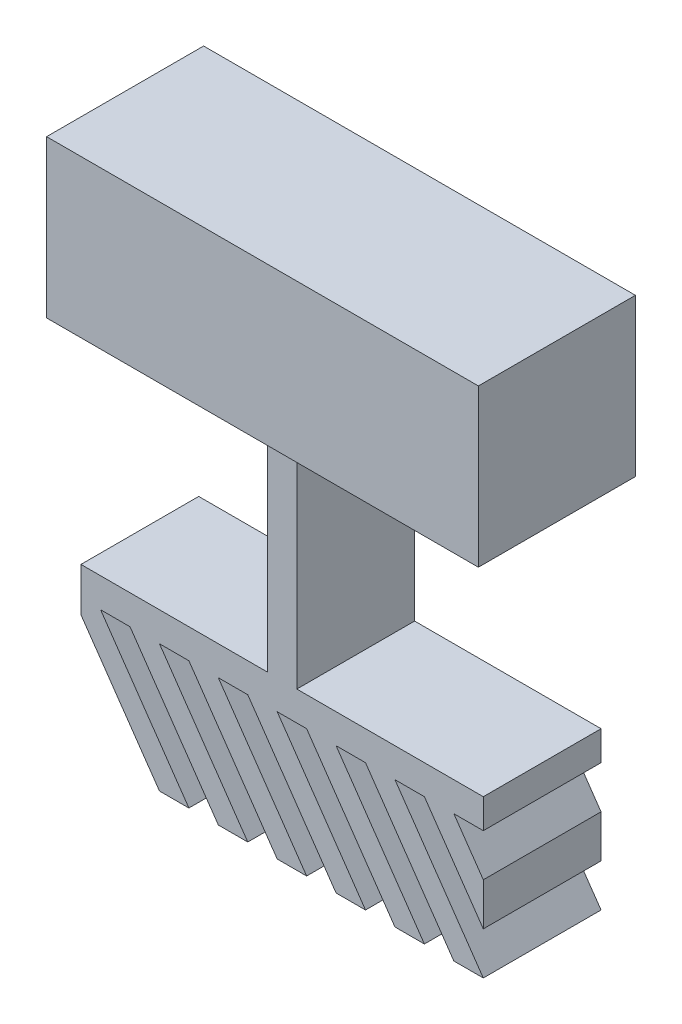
from build123d import *

# Parameters (mm, degrees)
BOSS_EXTRU_1_DEPTH      = 40
BOSS_EXTRU_1_DEPTH_BACK = 40
ESQUISSE3_W             = 220
ESQUISSE3_H             = 80
BOSS_EXTRU_2_DEPTH      = 30
BOSS_EXTRU_2_DEPTH_BACK = 30


with BuildPart() as part:
    # Esquisse3 → Boss.-Extru.1 (new, two sides: drawn at the far end of the back side and taken through both)
    with BuildSketch(Plane.XY.offset(-BOSS_EXTRU_1_DEPTH_BACK)):
        Rectangle(ESQUISSE3_W, ESQUISSE3_H)
    extrude(amount=BOSS_EXTRU_1_DEPTH + BOSS_EXTRU_1_DEPTH_BACK)


with BuildPart() as body_2:
    # Esquisse1 → Boss.-Extru.2 (new, two sides: drawn at the far end of the back side and taken through both)
    with BuildSketch(Plane.XY.offset(-BOSS_EXTRU_2_DEPTH_BACK)):
        Polygon((-7.5, 0), (7.5, 0), (7.5, -150), (102.5, -150), (102.5, -165), (87.5, -165), (102.5, -186.666666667), (102.5, -208.333333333), (72.5, -165), (57.5, -165), (102.5, -230), (87.5, -230), (42.5, -165), (27.5, -165), (72.5, -230), (57.5, -230), (12.5, -165), (-2.5, -165), (42.5, -230), (27.5, -230), (-17.5, -165), (-32.5, -165), (12.5, -230), (-2.5, -230), (-47.5, -165), (-62.5, -165), (-17.5, -230), (-32.5, -230), (-77.5, -165), (-92.5, -165), (-47.5, -230), (-62.5, -230), (-102.5, -172.222222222), (-102.5, -150), (-7.5, -150), align=None)
    extrude(amount=BOSS_EXTRU_2_DEPTH + BOSS_EXTRU_2_DEPTH_BACK)


solid = Compound([part.part, body_2.part])
